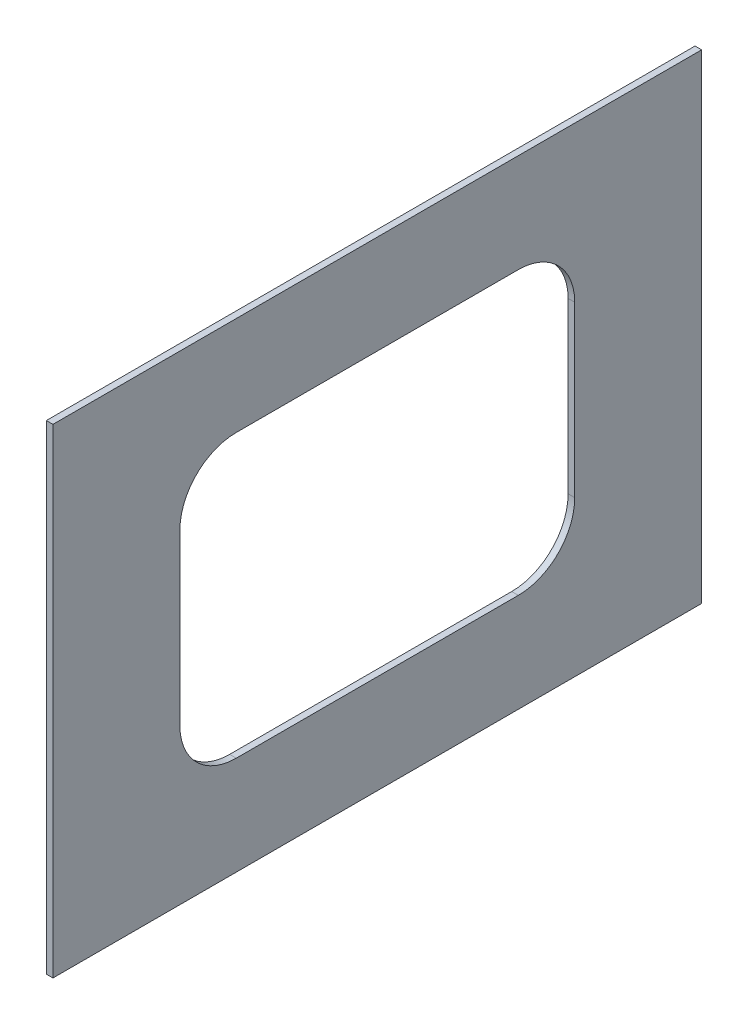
ISO-10303-21;
HEADER;
FILE_DESCRIPTION(('STEP AP214'),'2;1');
FILE_NAME('part.step','',(''),(''),'','','');
FILE_SCHEMA(('AUTOMOTIVE_DESIGN { 1 0 10303 214 1 1 1 1 }'));
ENDSEC;
DATA;
#1=APPLICATION_CONTEXT('core data for automotive mechanical design processes');
#2=APPLICATION_PROTOCOL_DEFINITION('international standard','automotive_design',2000,#1);
#3=PRODUCT_CONTEXT('',#1,'mechanical');
#4=PRODUCT('Part','Part','',(#3));
#5=PRODUCT_RELATED_PRODUCT_CATEGORY('part','',(#4));
#6=PRODUCT_DEFINITION_FORMATION('','',#4);
#7=PRODUCT_DEFINITION_CONTEXT('part definition',#1,'design');
#8=PRODUCT_DEFINITION('design','',#6,#7);
#9=PRODUCT_DEFINITION_SHAPE('','',#8);
#10=(LENGTH_UNIT() NAMED_UNIT(*) SI_UNIT(.MILLI.,.METRE.));
#11=(NAMED_UNIT(*) PLANE_ANGLE_UNIT() SI_UNIT($,.RADIAN.));
#12=(NAMED_UNIT(*) SI_UNIT($,.STERADIAN.) SOLID_ANGLE_UNIT());
#13=UNCERTAINTY_MEASURE_WITH_UNIT(LENGTH_MEASURE(1.E-05),#10,'distance_accuracy_value','');
#14=(GEOMETRIC_REPRESENTATION_CONTEXT(3) GLOBAL_UNCERTAINTY_ASSIGNED_CONTEXT((#13)) GLOBAL_UNIT_ASSIGNED_CONTEXT((#10,
#11,#12)) REPRESENTATION_CONTEXT('',''));
#15=CARTESIAN_POINT('',(0.,0.,0.));
#16=DIRECTION('',(0.,0.,1.));
#17=DIRECTION('',(1.,0.,0.));
#18=AXIS2_PLACEMENT_3D('',#15,#16,#17);
#19=CARTESIAN_POINT('',(11.90625,0.,0.));
#20=DIRECTION('',(-1.,0.,0.));
#21=DIRECTION('',(0.,0.,1.));
#22=AXIS2_PLACEMENT_3D('',#19,#20,#21);
#23=PLANE('',#22);
#24=DIRECTION('',(0.,-1.,0.));
#25=VECTOR('',#24,1.);
#26=CARTESIAN_POINT('',(11.90625,0.,0.));
#27=LINE('',#26,#25);
#28=CARTESIAN_POINT('',(11.90625,863.6,0.));
#29=VERTEX_POINT('',#28);
#30=CARTESIAN_POINT('',(11.90625,0.,0.));
#31=VERTEX_POINT('',#30);
#32=EDGE_CURVE('E216',#29,#31,#27,.T.);
#33=ORIENTED_EDGE('',*,*,#32,.T.);
#34=DIRECTION('',(0.,0.,-1.));
#35=VECTOR('',#34,1.);
#36=CARTESIAN_POINT('',(11.90625,0.,0.));
#37=LINE('',#36,#35);
#38=CARTESIAN_POINT('',(11.90625,0.,-1168.4));
#39=VERTEX_POINT('',#38);
#40=EDGE_CURVE('E220',#31,#39,#37,.T.);
#41=ORIENTED_EDGE('',*,*,#40,.T.);
#42=DIRECTION('',(0.,1.,0.));
#43=VECTOR('',#42,1.);
#44=CARTESIAN_POINT('',(11.90625,0.,-1168.4));
#45=LINE('',#44,#43);
#46=CARTESIAN_POINT('',(11.90625,863.6,-1168.4));
#47=VERTEX_POINT('',#46);
#48=EDGE_CURVE('E224',#39,#47,#45,.T.);
#49=ORIENTED_EDGE('',*,*,#48,.T.);
#50=DIRECTION('',(0.,0.,1.));
#51=VECTOR('',#50,1.);
#52=CARTESIAN_POINT('',(11.90625,863.6,0.));
#53=LINE('',#52,#51);
#54=EDGE_CURVE('E227',#47,#29,#53,.T.);
#55=ORIENTED_EDGE('',*,*,#54,.T.);
#56=EDGE_LOOP('',(#33,#41,#49,#55));
#57=FACE_BOUND('',#56,.T.);
#58=CARTESIAN_POINT('',(11.90625,279.4,-330.2));
#59=DIRECTION('',(1.,0.,0.));
#60=DIRECTION('',(0.,0.,-1.));
#61=AXIS2_PLACEMENT_3D('',#58,#59,#60);
#62=CIRCLE('',#61,101.6);
#63=CARTESIAN_POINT('',(11.90625,279.4,-228.6));
#64=VERTEX_POINT('',#63);
#65=CARTESIAN_POINT('',(11.90625,177.8,-330.2));
#66=VERTEX_POINT('',#65);
#67=EDGE_CURVE('E126',#64,#66,#62,.T.);
#68=ORIENTED_EDGE('',*,*,#67,.F.);
#69=DIRECTION('',(0.,-1.,0.));
#70=VECTOR('',#69,1.);
#71=CARTESIAN_POINT('',(11.90625,584.2,-228.6));
#72=LINE('',#71,#70);
#73=CARTESIAN_POINT('',(11.90625,584.2,-228.6));
#74=VERTEX_POINT('',#73);
#75=EDGE_CURVE('E168',#74,#64,#72,.T.);
#76=ORIENTED_EDGE('',*,*,#75,.F.);
#77=CARTESIAN_POINT('',(11.90625,584.2,-330.2));
#78=DIRECTION('',(1.,0.,0.));
#79=DIRECTION('',(0.,0.,-1.));
#80=AXIS2_PLACEMENT_3D('',#77,#78,#79);
#81=CIRCLE('',#80,101.6);
#82=CARTESIAN_POINT('',(11.90625,685.8,-330.2));
#83=VERTEX_POINT('',#82);
#84=EDGE_CURVE('E165',#83,#74,#81,.T.);
#85=ORIENTED_EDGE('',*,*,#84,.F.);
#86=DIRECTION('',(0.,0.,1.));
#87=VECTOR('',#86,1.);
#88=CARTESIAN_POINT('',(11.90625,685.8,-330.2));
#89=LINE('',#88,#87);
#90=CARTESIAN_POINT('',(11.90625,685.8,-838.2));
#91=VERTEX_POINT('',#90);
#92=EDGE_CURVE('E162',#91,#83,#89,.T.);
#93=ORIENTED_EDGE('',*,*,#92,.F.);
#94=CARTESIAN_POINT('',(11.90625,584.2,-838.2));
#95=DIRECTION('',(1.,0.,0.));
#96=DIRECTION('',(0.,0.,1.));
#97=AXIS2_PLACEMENT_3D('',#94,#95,#96);
#98=CIRCLE('',#97,101.6);
#99=CARTESIAN_POINT('',(11.90625,584.2,-939.8));
#100=VERTEX_POINT('',#99);
#101=EDGE_CURVE('E159',#100,#91,#98,.T.);
#102=ORIENTED_EDGE('',*,*,#101,.F.);
#103=DIRECTION('',(0.,1.,0.));
#104=VECTOR('',#103,1.);
#105=CARTESIAN_POINT('',(11.90625,584.2,-939.8));
#106=LINE('',#105,#104);
#107=CARTESIAN_POINT('',(11.90625,279.4,-939.8));
#108=VERTEX_POINT('',#107);
#109=EDGE_CURVE('E154',#108,#100,#106,.T.);
#110=ORIENTED_EDGE('',*,*,#109,.F.);
#111=CARTESIAN_POINT('',(11.90625,279.4,-838.2));
#112=DIRECTION('',(1.,0.,0.));
#113=DIRECTION('',(0.,0.,-1.));
#114=AXIS2_PLACEMENT_3D('',#111,#112,#113);
#115=CIRCLE('',#114,101.6);
#116=CARTESIAN_POINT('',(11.90625,177.8,-838.2));
#117=VERTEX_POINT('',#116);
#118=EDGE_CURVE('E149',#117,#108,#115,.T.);
#119=ORIENTED_EDGE('',*,*,#118,.F.);
#120=DIRECTION('',(0.,0.,-1.));
#121=VECTOR('',#120,1.);
#122=CARTESIAN_POINT('',(11.90625,177.8,-330.2));
#123=LINE('',#122,#121);
#124=EDGE_CURVE('E135',#66,#117,#123,.T.);
#125=ORIENTED_EDGE('',*,*,#124,.F.);
#126=EDGE_LOOP('',(#68,#76,#85,#93,#102,#110,#119,#125));
#127=FACE_BOUND('',#126,.T.);
#128=ADVANCED_FACE('F36',(#57,#127),#23,.F.);
#129=CARTESIAN_POINT('',(0.,0.,0.));
#130=DIRECTION('',(-1.,0.,0.));
#131=DIRECTION('',(0.,0.,1.));
#132=AXIS2_PLACEMENT_3D('',#129,#130,#131);
#133=PLANE('',#132);
#134=DIRECTION('',(0.,-1.,0.));
#135=VECTOR('',#134,1.);
#136=CARTESIAN_POINT('',(0.,0.,0.));
#137=LINE('',#136,#135);
#138=CARTESIAN_POINT('',(0.,863.6,0.));
#139=VERTEX_POINT('',#138);
#140=CARTESIAN_POINT('',(0.,0.,0.));
#141=VERTEX_POINT('',#140);
#142=EDGE_CURVE('E144',#139,#141,#137,.T.);
#143=ORIENTED_EDGE('',*,*,#142,.F.);
#144=DIRECTION('',(0.,0.,1.));
#145=VECTOR('',#144,1.);
#146=CARTESIAN_POINT('',(0.,863.6,0.));
#147=LINE('',#146,#145);
#148=CARTESIAN_POINT('',(0.,863.6,-1168.4));
#149=VERTEX_POINT('',#148);
#150=EDGE_CURVE('E221',#149,#139,#147,.T.);
#151=ORIENTED_EDGE('',*,*,#150,.F.);
#152=DIRECTION('',(0.,1.,0.));
#153=VECTOR('',#152,1.);
#154=CARTESIAN_POINT('',(0.,0.,-1168.4));
#155=LINE('',#154,#153);
#156=CARTESIAN_POINT('',(0.,0.,-1168.4));
#157=VERTEX_POINT('',#156);
#158=EDGE_CURVE('E237',#157,#149,#155,.T.);
#159=ORIENTED_EDGE('',*,*,#158,.F.);
#160=DIRECTION('',(0.,0.,-1.));
#161=VECTOR('',#160,1.);
#162=CARTESIAN_POINT('',(0.,0.,0.));
#163=LINE('',#162,#161);
#164=EDGE_CURVE('E234',#141,#157,#163,.T.);
#165=ORIENTED_EDGE('',*,*,#164,.F.);
#166=EDGE_LOOP('',(#143,#151,#159,#165));
#167=FACE_BOUND('',#166,.T.);
#168=DIRECTION('',(0.,-1.,0.));
#169=VECTOR('',#168,1.);
#170=CARTESIAN_POINT('',(0.,584.2,-228.6));
#171=LINE('',#170,#169);
#172=CARTESIAN_POINT('',(0.,584.2,-228.6));
#173=VERTEX_POINT('',#172);
#174=CARTESIAN_POINT('',(0.,279.4,-228.6));
#175=VERTEX_POINT('',#174);
#176=EDGE_CURVE('E136',#173,#175,#171,.T.);
#177=ORIENTED_EDGE('',*,*,#176,.T.);
#178=CARTESIAN_POINT('',(0.,279.4,-330.2));
#179=DIRECTION('',(1.,0.,0.));
#180=DIRECTION('',(0.,0.,-1.));
#181=AXIS2_PLACEMENT_3D('',#178,#179,#180);
#182=CIRCLE('',#181,101.6);
#183=CARTESIAN_POINT('',(0.,177.8,-330.2));
#184=VERTEX_POINT('',#183);
#185=EDGE_CURVE('E60',#175,#184,#182,.T.);
#186=ORIENTED_EDGE('',*,*,#185,.T.);
#187=DIRECTION('',(0.,0.,-1.));
#188=VECTOR('',#187,1.);
#189=CARTESIAN_POINT('',(0.,177.8,-330.2));
#190=LINE('',#189,#188);
#191=CARTESIAN_POINT('',(0.,177.8,-838.2));
#192=VERTEX_POINT('',#191);
#193=EDGE_CURVE('E142',#184,#192,#190,.T.);
#194=ORIENTED_EDGE('',*,*,#193,.T.);
#195=CARTESIAN_POINT('',(0.,279.4,-838.2));
#196=DIRECTION('',(1.,0.,0.));
#197=DIRECTION('',(0.,0.,-1.));
#198=AXIS2_PLACEMENT_3D('',#195,#196,#197);
#199=CIRCLE('',#198,101.6);
#200=CARTESIAN_POINT('',(0.,279.4,-939.8));
#201=VERTEX_POINT('',#200);
#202=EDGE_CURVE('E175',#192,#201,#199,.T.);
#203=ORIENTED_EDGE('',*,*,#202,.T.);
#204=DIRECTION('',(0.,1.,0.));
#205=VECTOR('',#204,1.);
#206=CARTESIAN_POINT('',(0.,584.2,-939.8));
#207=LINE('',#206,#205);
#208=CARTESIAN_POINT('',(0.,584.2,-939.8));
#209=VERTEX_POINT('',#208);
#210=EDGE_CURVE('E179',#201,#209,#207,.T.);
#211=ORIENTED_EDGE('',*,*,#210,.T.);
#212=CARTESIAN_POINT('',(0.,584.2,-838.2));
#213=DIRECTION('',(1.,0.,0.));
#214=DIRECTION('',(0.,0.,1.));
#215=AXIS2_PLACEMENT_3D('',#212,#213,#214);
#216=CIRCLE('',#215,101.6);
#217=CARTESIAN_POINT('',(0.,685.8,-838.2));
#218=VERTEX_POINT('',#217);
#219=EDGE_CURVE('E183',#209,#218,#216,.T.);
#220=ORIENTED_EDGE('',*,*,#219,.T.);
#221=DIRECTION('',(0.,0.,1.));
#222=VECTOR('',#221,1.);
#223=CARTESIAN_POINT('',(0.,685.8,-330.2));
#224=LINE('',#223,#222);
#225=CARTESIAN_POINT('',(0.,685.8,-330.2));
#226=VERTEX_POINT('',#225);
#227=EDGE_CURVE('E187',#218,#226,#224,.T.);
#228=ORIENTED_EDGE('',*,*,#227,.T.);
#229=CARTESIAN_POINT('',(0.,584.2,-330.2));
#230=DIRECTION('',(1.,0.,0.));
#231=DIRECTION('',(0.,0.,-1.));
#232=AXIS2_PLACEMENT_3D('',#229,#230,#231);
#233=CIRCLE('',#232,101.6);
#234=EDGE_CURVE('E191',#226,#173,#233,.T.);
#235=ORIENTED_EDGE('',*,*,#234,.T.);
#236=EDGE_LOOP('',(#177,#186,#194,#203,#211,#220,#228,#235));
#237=FACE_BOUND('',#236,.T.);
#238=ADVANCED_FACE('F261',(#167,#237),#133,.T.);
#239=CARTESIAN_POINT('',(11.90625,0.,0.));
#240=DIRECTION('',(0.,0.,-1.));
#241=DIRECTION('',(-1.,0.,0.));
#242=AXIS2_PLACEMENT_3D('',#239,#240,#241);
#243=PLANE('',#242);
#244=ORIENTED_EDGE('',*,*,#142,.T.);
#245=DIRECTION('',(-1.,0.,0.));
#246=VECTOR('',#245,1.);
#247=CARTESIAN_POINT('',(11.90625,0.,0.));
#248=LINE('',#247,#246);
#249=EDGE_CURVE('E11',#31,#141,#248,.T.);
#250=ORIENTED_EDGE('',*,*,#249,.F.);
#251=ORIENTED_EDGE('',*,*,#32,.F.);
#252=DIRECTION('',(-1.,0.,0.));
#253=VECTOR('',#252,1.);
#254=CARTESIAN_POINT('',(11.90625,863.6,0.));
#255=LINE('',#254,#253);
#256=EDGE_CURVE('E230',#29,#139,#255,.T.);
#257=ORIENTED_EDGE('',*,*,#256,.T.);
#258=EDGE_LOOP('',(#244,#250,#251,#257));
#259=FACE_BOUND('',#258,.T.);
#260=ADVANCED_FACE('F38',(#259),#243,.F.);
#261=CARTESIAN_POINT('',(11.90625,0.,0.));
#262=DIRECTION('',(0.,1.,0.));
#263=DIRECTION('',(0.,0.,1.));
#264=AXIS2_PLACEMENT_3D('',#261,#262,#263);
#265=PLANE('',#264);
#266=ORIENTED_EDGE('',*,*,#164,.T.);
#267=DIRECTION('',(-1.,0.,0.));
#268=VECTOR('',#267,1.);
#269=CARTESIAN_POINT('',(11.90625,0.,-1168.4));
#270=LINE('',#269,#268);
#271=EDGE_CURVE('E45',#39,#157,#270,.T.);
#272=ORIENTED_EDGE('',*,*,#271,.F.);
#273=ORIENTED_EDGE('',*,*,#40,.F.);
#274=ORIENTED_EDGE('',*,*,#249,.T.);
#275=EDGE_LOOP('',(#266,#272,#273,#274));
#276=FACE_BOUND('',#275,.T.);
#277=ADVANCED_FACE('F271',(#276),#265,.F.);
#278=CARTESIAN_POINT('',(11.90625,0.,-1168.4));
#279=DIRECTION('',(0.,0.,1.));
#280=DIRECTION('',(1.,0.,0.));
#281=AXIS2_PLACEMENT_3D('',#278,#279,#280);
#282=PLANE('',#281);
#283=ORIENTED_EDGE('',*,*,#158,.T.);
#284=DIRECTION('',(-1.,0.,0.));
#285=VECTOR('',#284,1.);
#286=CARTESIAN_POINT('',(11.90625,863.6,-1168.4));
#287=LINE('',#286,#285);
#288=EDGE_CURVE('E245',#47,#149,#287,.T.);
#289=ORIENTED_EDGE('',*,*,#288,.F.);
#290=ORIENTED_EDGE('',*,*,#48,.F.);
#291=ORIENTED_EDGE('',*,*,#271,.T.);
#292=EDGE_LOOP('',(#283,#289,#290,#291));
#293=FACE_BOUND('',#292,.T.);
#294=ADVANCED_FACE('F255',(#293),#282,.F.);
#295=CARTESIAN_POINT('',(11.90625,863.6,0.));
#296=DIRECTION('',(0.,-1.,0.));
#297=DIRECTION('',(0.,0.,-1.));
#298=AXIS2_PLACEMENT_3D('',#295,#296,#297);
#299=PLANE('',#298);
#300=ORIENTED_EDGE('',*,*,#150,.T.);
#301=ORIENTED_EDGE('',*,*,#256,.F.);
#302=ORIENTED_EDGE('',*,*,#54,.F.);
#303=ORIENTED_EDGE('',*,*,#288,.T.);
#304=EDGE_LOOP('',(#300,#301,#302,#303));
#305=FACE_BOUND('',#304,.T.);
#306=ADVANCED_FACE('F265',(#305),#299,.F.);
#307=CARTESIAN_POINT('',(11.90625,279.4,-330.2));
#308=DIRECTION('',(-1.,0.,0.));
#309=DIRECTION('',(0.,0.,1.));
#310=AXIS2_PLACEMENT_3D('',#307,#308,#309);
#311=CYLINDRICAL_SURFACE('',#310,101.6);
#312=ORIENTED_EDGE('',*,*,#185,.F.);
#313=DIRECTION('',(-1.,0.,0.));
#314=VECTOR('',#313,1.);
#315=CARTESIAN_POINT('',(11.90625,279.4,-228.6));
#316=LINE('',#315,#314);
#317=EDGE_CURVE('E130',#64,#175,#316,.T.);
#318=ORIENTED_EDGE('',*,*,#317,.F.);
#319=ORIENTED_EDGE('',*,*,#67,.T.);
#320=DIRECTION('',(-1.,0.,0.));
#321=VECTOR('',#320,1.);
#322=CARTESIAN_POINT('',(11.90625,177.8,-330.2));
#323=LINE('',#322,#321);
#324=EDGE_CURVE('E129',#66,#184,#323,.T.);
#325=ORIENTED_EDGE('',*,*,#324,.T.);
#326=EDGE_LOOP('',(#312,#318,#319,#325));
#327=FACE_BOUND('',#326,.T.);
#328=ADVANCED_FACE('F128',(#327),#311,.F.);
#329=CARTESIAN_POINT('',(11.90625,177.8,-330.2));
#330=DIRECTION('',(0.,1.,0.));
#331=DIRECTION('',(0.,0.,1.));
#332=AXIS2_PLACEMENT_3D('',#329,#330,#331);
#333=PLANE('',#332);
#334=ORIENTED_EDGE('',*,*,#193,.F.);
#335=ORIENTED_EDGE('',*,*,#324,.F.);
#336=ORIENTED_EDGE('',*,*,#124,.T.);
#337=DIRECTION('',(-1.,0.,0.));
#338=VECTOR('',#337,1.);
#339=CARTESIAN_POINT('',(11.90625,177.8,-838.2));
#340=LINE('',#339,#338);
#341=EDGE_CURVE('E145',#117,#192,#340,.T.);
#342=ORIENTED_EDGE('',*,*,#341,.T.);
#343=EDGE_LOOP('',(#334,#335,#336,#342));
#344=FACE_BOUND('',#343,.T.);
#345=ADVANCED_FACE('F139',(#344),#333,.T.);
#346=CARTESIAN_POINT('',(11.90625,279.4,-838.2));
#347=DIRECTION('',(-1.,0.,0.));
#348=DIRECTION('',(0.,0.,1.));
#349=AXIS2_PLACEMENT_3D('',#346,#347,#348);
#350=CYLINDRICAL_SURFACE('',#349,101.6);
#351=ORIENTED_EDGE('',*,*,#202,.F.);
#352=ORIENTED_EDGE('',*,*,#341,.F.);
#353=ORIENTED_EDGE('',*,*,#118,.T.);
#354=DIRECTION('',(-1.,0.,0.));
#355=VECTOR('',#354,1.);
#356=CARTESIAN_POINT('',(11.90625,279.4,-939.8));
#357=LINE('',#356,#355);
#358=EDGE_CURVE('E211',#108,#201,#357,.T.);
#359=ORIENTED_EDGE('',*,*,#358,.T.);
#360=EDGE_LOOP('',(#351,#352,#353,#359));
#361=FACE_BOUND('',#360,.T.);
#362=ADVANCED_FACE('F294',(#361),#350,.F.);
#363=CARTESIAN_POINT('',(11.90625,584.2,-939.8));
#364=DIRECTION('',(0.,0.,1.));
#365=DIRECTION('',(0.,-1.,0.));
#366=AXIS2_PLACEMENT_3D('',#363,#364,#365);
#367=PLANE('',#366);
#368=ORIENTED_EDGE('',*,*,#210,.F.);
#369=ORIENTED_EDGE('',*,*,#358,.F.);
#370=ORIENTED_EDGE('',*,*,#109,.T.);
#371=DIRECTION('',(-1.,0.,0.));
#372=VECTOR('',#371,1.);
#373=CARTESIAN_POINT('',(11.90625,584.2,-939.8));
#374=LINE('',#373,#372);
#375=EDGE_CURVE('E208',#100,#209,#374,.T.);
#376=ORIENTED_EDGE('',*,*,#375,.T.);
#377=EDGE_LOOP('',(#368,#369,#370,#376));
#378=FACE_BOUND('',#377,.T.);
#379=ADVANCED_FACE('F298',(#378),#367,.T.);
#380=CARTESIAN_POINT('',(11.90625,584.2,-838.2));
#381=DIRECTION('',(-1.,0.,0.));
#382=DIRECTION('',(0.,0.,1.));
#383=AXIS2_PLACEMENT_3D('',#380,#381,#382);
#384=CYLINDRICAL_SURFACE('',#383,101.6);
#385=ORIENTED_EDGE('',*,*,#219,.F.);
#386=ORIENTED_EDGE('',*,*,#375,.F.);
#387=ORIENTED_EDGE('',*,*,#101,.T.);
#388=DIRECTION('',(-1.,0.,0.));
#389=VECTOR('',#388,1.);
#390=CARTESIAN_POINT('',(11.90625,685.8,-838.2));
#391=LINE('',#390,#389);
#392=EDGE_CURVE('E205',#91,#218,#391,.T.);
#393=ORIENTED_EDGE('',*,*,#392,.T.);
#394=EDGE_LOOP('',(#385,#386,#387,#393));
#395=FACE_BOUND('',#394,.T.);
#396=ADVANCED_FACE('F304',(#395),#384,.F.);
#397=CARTESIAN_POINT('',(11.90625,685.8,-330.2));
#398=DIRECTION('',(0.,-1.,0.));
#399=DIRECTION('',(0.,0.,-1.));
#400=AXIS2_PLACEMENT_3D('',#397,#398,#399);
#401=PLANE('',#400);
#402=ORIENTED_EDGE('',*,*,#227,.F.);
#403=ORIENTED_EDGE('',*,*,#392,.F.);
#404=ORIENTED_EDGE('',*,*,#92,.T.);
#405=DIRECTION('',(-1.,0.,0.));
#406=VECTOR('',#405,1.);
#407=CARTESIAN_POINT('',(11.90625,685.8,-330.2));
#408=LINE('',#407,#406);
#409=EDGE_CURVE('E202',#83,#226,#408,.T.);
#410=ORIENTED_EDGE('',*,*,#409,.T.);
#411=EDGE_LOOP('',(#402,#403,#404,#410));
#412=FACE_BOUND('',#411,.T.);
#413=ADVANCED_FACE('F308',(#412),#401,.T.);
#414=CARTESIAN_POINT('',(11.90625,584.2,-330.2));
#415=DIRECTION('',(-1.,0.,0.));
#416=DIRECTION('',(0.,0.,1.));
#417=AXIS2_PLACEMENT_3D('',#414,#415,#416);
#418=CYLINDRICAL_SURFACE('',#417,101.6);
#419=ORIENTED_EDGE('',*,*,#234,.F.);
#420=ORIENTED_EDGE('',*,*,#409,.F.);
#421=ORIENTED_EDGE('',*,*,#84,.T.);
#422=DIRECTION('',(-1.,0.,0.));
#423=VECTOR('',#422,1.);
#424=CARTESIAN_POINT('',(11.90625,584.2,-228.6));
#425=LINE('',#424,#423);
#426=EDGE_CURVE('E52',#74,#173,#425,.T.);
#427=ORIENTED_EDGE('',*,*,#426,.T.);
#428=EDGE_LOOP('',(#419,#420,#421,#427));
#429=FACE_BOUND('',#428,.T.);
#430=ADVANCED_FACE('F312',(#429),#418,.F.);
#431=CARTESIAN_POINT('',(11.90625,584.2,-228.6));
#432=DIRECTION('',(0.,0.,-1.));
#433=DIRECTION('',(-1.,0.,0.));
#434=AXIS2_PLACEMENT_3D('',#431,#432,#433);
#435=PLANE('',#434);
#436=ORIENTED_EDGE('',*,*,#176,.F.);
#437=ORIENTED_EDGE('',*,*,#426,.F.);
#438=ORIENTED_EDGE('',*,*,#75,.T.);
#439=ORIENTED_EDGE('',*,*,#317,.T.);
#440=EDGE_LOOP('',(#436,#437,#438,#439));
#441=FACE_BOUND('',#440,.T.);
#442=ADVANCED_FACE('F316',(#441),#435,.T.);
#443=CLOSED_SHELL('',(#128,#238,#260,#277,#294,#306,#328,#345,#362,#379,#396,#413,#430,#442));
#444=MANIFOLD_SOLID_BREP('B2',#443);
#445=ADVANCED_BREP_SHAPE_REPRESENTATION('',(#18,#444),#14);
#446=SHAPE_DEFINITION_REPRESENTATION(#9,#445);
ENDSEC;
END-ISO-10303-21;
